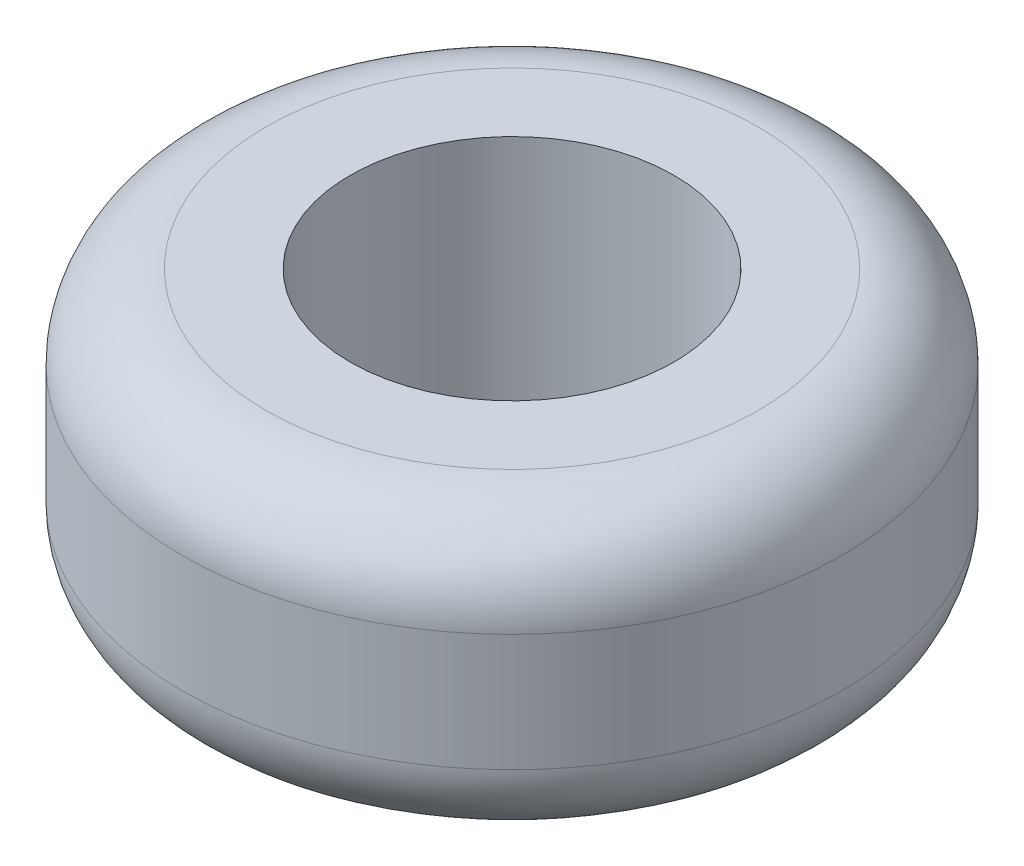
ISO-10303-21;
HEADER;
FILE_DESCRIPTION(('STEP AP214'),'2;1');
FILE_NAME('part.step','',(''),(''),'','','');
FILE_SCHEMA(('AUTOMOTIVE_DESIGN { 1 0 10303 214 1 1 1 1 }'));
ENDSEC;
DATA;
#1=APPLICATION_CONTEXT('core data for automotive mechanical design processes');
#2=APPLICATION_PROTOCOL_DEFINITION('international standard','automotive_design',2000,#1);
#3=PRODUCT_CONTEXT('',#1,'mechanical');
#4=PRODUCT('Part','Part','',(#3));
#5=PRODUCT_RELATED_PRODUCT_CATEGORY('part','',(#4));
#6=PRODUCT_DEFINITION_FORMATION('','',#4);
#7=PRODUCT_DEFINITION_CONTEXT('part definition',#1,'design');
#8=PRODUCT_DEFINITION('design','',#6,#7);
#9=PRODUCT_DEFINITION_SHAPE('','',#8);
#10=(LENGTH_UNIT() NAMED_UNIT(*) SI_UNIT(.MILLI.,.METRE.));
#11=(NAMED_UNIT(*) PLANE_ANGLE_UNIT() SI_UNIT($,.RADIAN.));
#12=(NAMED_UNIT(*) SI_UNIT($,.STERADIAN.) SOLID_ANGLE_UNIT());
#13=UNCERTAINTY_MEASURE_WITH_UNIT(LENGTH_MEASURE(1.E-05),#10,'distance_accuracy_value','');
#14=(GEOMETRIC_REPRESENTATION_CONTEXT(3) GLOBAL_UNCERTAINTY_ASSIGNED_CONTEXT((#13)) GLOBAL_UNIT_ASSIGNED_CONTEXT((#10,
#11,#12)) REPRESENTATION_CONTEXT('',''));
#15=CARTESIAN_POINT('',(0.,0.,0.));
#16=DIRECTION('',(0.,0.,1.));
#17=DIRECTION('',(1.,0.,0.));
#18=AXIS2_PLACEMENT_3D('',#15,#16,#17);
#19=CARTESIAN_POINT('',(0.,10.795,0.));
#20=DIRECTION('',(0.,1.,0.));
#21=DIRECTION('',(0.,0.,1.));
#22=AXIS2_PLACEMENT_3D('',#19,#20,#21);
#23=PLANE('',#22);
#24=CARTESIAN_POINT('',(0.,10.795,0.));
#25=DIRECTION('',(0.,1.,0.));
#26=DIRECTION('',(0.,0.,1.));
#27=AXIS2_PLACEMENT_3D('',#24,#25,#26);
#28=CIRCLE('',#27,9.3265625);
#29=CARTESIAN_POINT('',(0.,10.795,9.3265625));
#30=VERTEX_POINT('',#29);
#31=EDGE_CURVE('E10',#30,#30,#28,.T.);
#32=ORIENTED_EDGE('',*,*,#31,.T.);
#33=EDGE_LOOP('',(#32));
#34=FACE_BOUND('',#33,.T.);
#35=CARTESIAN_POINT('',(0.,10.795,0.));
#36=DIRECTION('',(0.,1.,0.));
#37=DIRECTION('',(0.,0.,1.));
#38=AXIS2_PLACEMENT_3D('',#35,#36,#37);
#39=CIRCLE('',#38,6.14045);
#40=CARTESIAN_POINT('',(0.,10.795,6.14045));
#41=VERTEX_POINT('',#40);
#42=EDGE_CURVE('E51',#41,#41,#39,.T.);
#43=ORIENTED_EDGE('',*,*,#42,.F.);
#44=EDGE_LOOP('',(#43));
#45=FACE_BOUND('',#44,.T.);
#46=ADVANCED_FACE('F31',(#34,#45),#23,.T.);
#47=CARTESIAN_POINT('',(0.,0.,0.));
#48=DIRECTION('',(0.,1.,0.));
#49=DIRECTION('',(0.,0.,1.));
#50=AXIS2_PLACEMENT_3D('',#47,#48,#49);
#51=PLANE('',#50);
#52=CARTESIAN_POINT('',(0.,0.,0.));
#53=DIRECTION('',(0.,1.,0.));
#54=DIRECTION('',(0.,0.,1.));
#55=AXIS2_PLACEMENT_3D('',#52,#53,#54);
#56=CIRCLE('',#55,9.3265625);
#57=CARTESIAN_POINT('',(0.,0.,9.3265625));
#58=VERTEX_POINT('',#57);
#59=EDGE_CURVE('E38',#58,#58,#56,.F.);
#60=ORIENTED_EDGE('',*,*,#59,.T.);
#61=EDGE_LOOP('',(#60));
#62=FACE_BOUND('',#61,.T.);
#63=CARTESIAN_POINT('',(0.,0.,0.));
#64=DIRECTION('',(0.,1.,0.));
#65=DIRECTION('',(0.,0.,1.));
#66=AXIS2_PLACEMENT_3D('',#63,#64,#65);
#67=CIRCLE('',#66,6.14045);
#68=CARTESIAN_POINT('',(0.,0.,6.14045));
#69=VERTEX_POINT('',#68);
#70=EDGE_CURVE('E52',#69,#69,#67,.T.);
#71=ORIENTED_EDGE('',*,*,#70,.T.);
#72=EDGE_LOOP('',(#71));
#73=FACE_BOUND('',#72,.T.);
#74=ADVANCED_FACE('F62',(#62,#73),#51,.F.);
#75=CARTESIAN_POINT('',(0.,10.795,0.));
#76=DIRECTION('',(0.,-1.,0.));
#77=DIRECTION('',(0.,0.,-1.));
#78=AXIS2_PLACEMENT_3D('',#75,#76,#77);
#79=CYLINDRICAL_SURFACE('',#78,12.5015625);
#80=CARTESIAN_POINT('',(0.,3.175,0.));
#81=DIRECTION('',(0.,1.,0.));
#82=DIRECTION('',(0.,0.,1.));
#83=AXIS2_PLACEMENT_3D('',#80,#81,#82);
#84=CIRCLE('',#83,12.5015625);
#85=CARTESIAN_POINT('',(0.,3.175,12.5015625));
#86=VERTEX_POINT('',#85);
#87=EDGE_CURVE('E42',#86,#86,#84,.T.);
#88=ORIENTED_EDGE('',*,*,#87,.T.);
#89=EDGE_LOOP('',(#88));
#90=FACE_BOUND('',#89,.T.);
#91=CARTESIAN_POINT('',(0.,7.62,0.));
#92=DIRECTION('',(0.,1.,0.));
#93=DIRECTION('',(0.,0.,1.));
#94=AXIS2_PLACEMENT_3D('',#91,#92,#93);
#95=CIRCLE('',#94,12.5015625);
#96=CARTESIAN_POINT('',(0.,7.62,12.5015625));
#97=VERTEX_POINT('',#96);
#98=EDGE_CURVE('E46',#97,#97,#95,.F.);
#99=ORIENTED_EDGE('',*,*,#98,.T.);
#100=EDGE_LOOP('',(#99));
#101=FACE_BOUND('',#100,.T.);
#102=ADVANCED_FACE('F67',(#90,#101),#79,.T.);
#103=CARTESIAN_POINT('',(0.,10.795,0.));
#104=DIRECTION('',(0.,-1.,0.));
#105=DIRECTION('',(0.,0.,-1.));
#106=AXIS2_PLACEMENT_3D('',#103,#104,#105);
#107=CYLINDRICAL_SURFACE('',#106,6.14045);
#108=ORIENTED_EDGE('',*,*,#42,.T.);
#109=EDGE_LOOP('',(#108));
#110=FACE_BOUND('',#109,.T.);
#111=ORIENTED_EDGE('',*,*,#70,.F.);
#112=EDGE_LOOP('',(#111));
#113=FACE_BOUND('',#112,.T.);
#114=ADVANCED_FACE('F58',(#110,#113),#107,.F.);
#115=CARTESIAN_POINT('',(0.,3.175,0.));
#116=DIRECTION('',(0.,1.,0.));
#117=DIRECTION('',(0.,0.,1.));
#118=AXIS2_PLACEMENT_3D('',#115,#116,#117);
#119=TOROIDAL_SURFACE('',#118,9.3265625,3.175);
#120=ORIENTED_EDGE('',*,*,#59,.F.);
#121=EDGE_LOOP('',(#120));
#122=FACE_BOUND('',#121,.T.);
#123=ORIENTED_EDGE('',*,*,#87,.F.);
#124=EDGE_LOOP('',(#123));
#125=FACE_BOUND('',#124,.T.);
#126=ADVANCED_FACE('F73',(#122,#125),#119,.T.);
#127=CARTESIAN_POINT('',(0.,7.62,0.));
#128=DIRECTION('',(0.,1.,0.));
#129=DIRECTION('',(0.,0.,1.));
#130=AXIS2_PLACEMENT_3D('',#127,#128,#129);
#131=TOROIDAL_SURFACE('',#130,9.3265625,3.175);
#132=ORIENTED_EDGE('',*,*,#98,.F.);
#133=EDGE_LOOP('',(#132));
#134=FACE_BOUND('',#133,.T.);
#135=ORIENTED_EDGE('',*,*,#31,.F.);
#136=EDGE_LOOP('',(#135));
#137=FACE_BOUND('',#136,.T.);
#138=ADVANCED_FACE('F33',(#134,#137),#131,.T.);
#139=CLOSED_SHELL('',(#46,#74,#102,#114,#126,#138));
#140=MANIFOLD_SOLID_BREP('B2',#139);
#141=ADVANCED_BREP_SHAPE_REPRESENTATION('',(#18,#140),#14);
#142=SHAPE_DEFINITION_REPRESENTATION(#9,#141);
ENDSEC;
END-ISO-10303-21;
